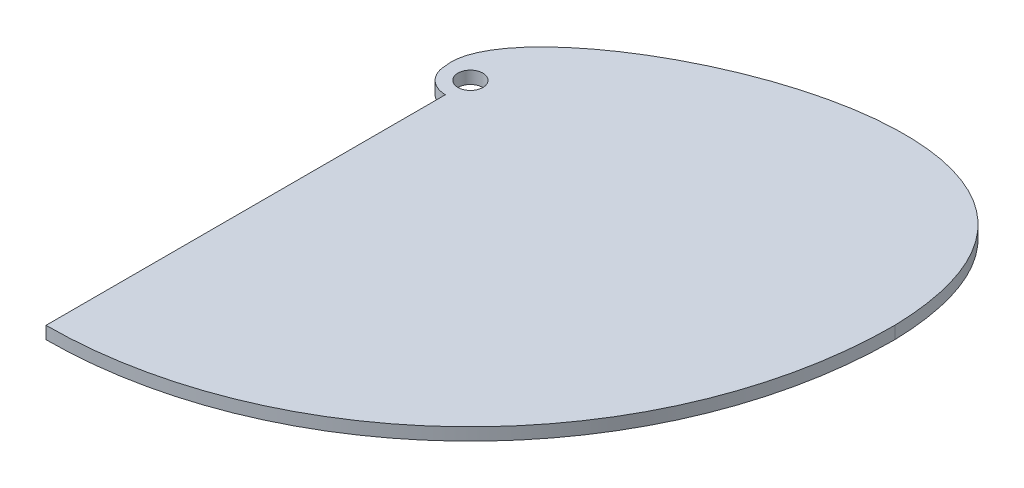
from build123d import *

# Parameters (mm, degrees)
SKETCH2_R           = 3.175
BOSS_EXTRUDE2_DEPTH = 3.175


with BuildPart() as part:
    # Sketch2 → Boss-Extrude2 (new body)
    with BuildSketch(Plane(origin=(0, 0, 0), x_dir=(1, 0, 0), z_dir=(0, 1, 0))):
        with BuildLine():
            Line((0, -6.35), (0, -107.95))
            ThreePointArc((0, -107.95), (76.332177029, -76.332177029), (107.95, 0))
            add(Edge.make_bspline(
                [(-6.35, 0), (-11.092453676, 26.631504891), (105.864942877, 82.50831116), (107.95, 0)],
                knots=[0, 0, 0, 0, 1, 1, 1, 1], degree=3))
            ThreePointArc((-6.35, 0), (-4.490128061, -4.490128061), (0, -6.35))
        make_face()
        with Locations(Location((0, 0, 0), (0, 0, 270))):
            Circle(SKETCH2_R, mode=Mode.SUBTRACT)
    extrude(amount=BOSS_EXTRUDE2_DEPTH)


solid = part.part
